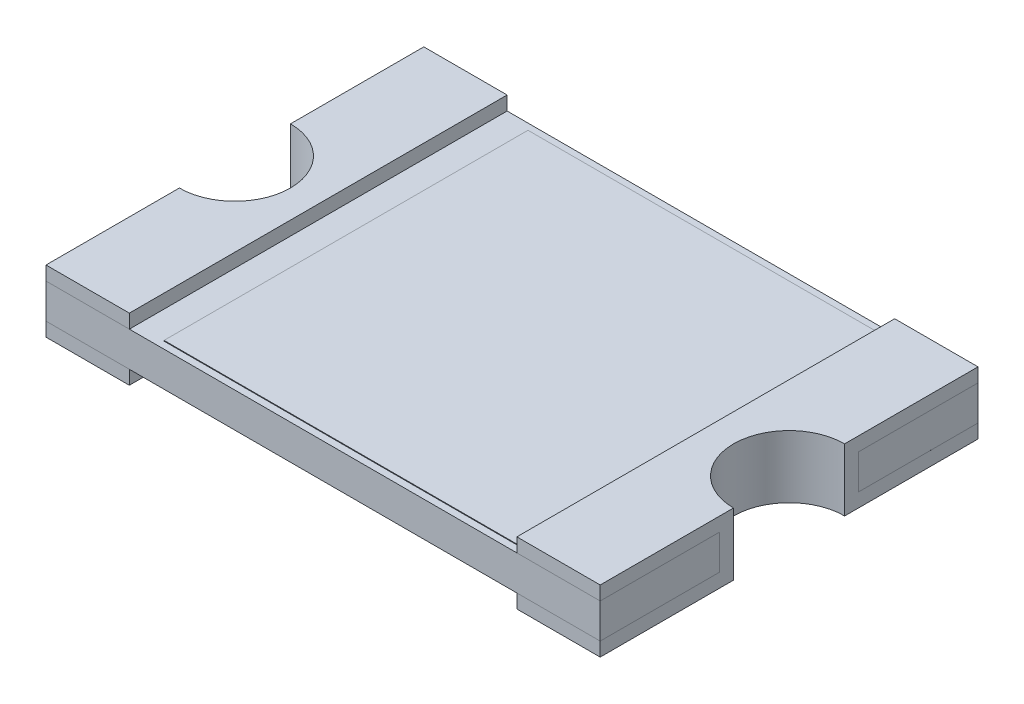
from build123d import *

# Parameters (mm, degrees)
BOSS_EXTRUDE1_START   = 2.72
SKETCH4_W             = 7.98
SKETCH4_H             = 0.5
BOSS_EXTRUDE1_DEPTH   = 5.44
BOSS_EXTRUDE2_START   = 2.72
SKETCH7_W             = 1.2
SKETCH7_H             = 0.2
BOSS_EXTRUDE2_DEPTH   = 5.44
BOSS_EXTRUDE2_2_DEPTH = 5.44
BOSS_EXTRUDE2_3_DEPTH = 5.44
BOSS_EXTRUDE2_4_DEPTH = 5.44
CUT_EXTRUDE1_DEPTH    = 5.912076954
BOSS_EXTRUDE3_DEPTH   = 0.9
BOSS_EXTRUDE4_START   = 0.7
SKETCH11_W            = 5.18
SKETCH11_H            = 5.24
BOSS_EXTRUDE4_DEPTH   = 0.01


with BuildPart() as part:
    # Sketch4 → Boss-Extrude1 (new body)
    with BuildSketch(Plane.XY.offset(BOSS_EXTRUDE1_START)):
        with Locations((0, 0.45)):
            Rectangle(SKETCH4_W, SKETCH4_H)
    extrude(amount=-BOSS_EXTRUDE1_DEPTH)


with BuildPart() as body_2:
    # Sketch7 → Boss-Extrude2 (new body)
    with BuildSketch(Plane.XY.offset(BOSS_EXTRUDE2_START)):
        with Locations((-3.39, 0.8)):
            Rectangle(SKETCH7_W, SKETCH7_H)
    extrude(amount=-BOSS_EXTRUDE2_DEPTH)


with BuildPart() as body_3:
    # Sketch7 → Boss-Extrude2 2 (new body)
    with BuildSketch(Plane.XY.offset(BOSS_EXTRUDE2_START)):
        with Locations((-3.39, 0.1)):
            Rectangle(SKETCH7_W, SKETCH7_H)
    extrude(amount=-BOSS_EXTRUDE2_2_DEPTH)


with BuildPart() as body_4:
    # Sketch7 → Boss-Extrude2 3 (new body)
    with BuildSketch(Plane.XY.offset(BOSS_EXTRUDE2_START)):
        with Locations((3.39, 0.8)):
            Rectangle(SKETCH7_W, SKETCH7_H)
    extrude(amount=-BOSS_EXTRUDE2_3_DEPTH)


with BuildPart() as body_5:
    # Sketch7 → Boss-Extrude2 4 (new body)
    with BuildSketch(Plane.XY.offset(BOSS_EXTRUDE2_START)):
        with Locations((3.39, 0.1)):
            Rectangle(SKETCH7_W, SKETCH7_H)
    extrude(amount=-BOSS_EXTRUDE2_4_DEPTH)


with BuildPart() as cut_extrude1_tool:
    # Sketch6 → Cut-Extrude1 (new, through all)
    with BuildSketch(Plane(origin=(0, 0, 0), x_dir=(1, 0, 0), z_dir=(0, 1, 0))):
        with BuildLine():
            Line((3.99, 1), (3.99, -1))
            ThreePointArc((3.99, -1), (2.99, 0), (3.99, 1))
        make_face()
        with BuildLine():
            Line((-3.99, 1), (-3.99, -1))
            ThreePointArc((-3.99, -1), (-2.99, 0), (-3.99, 1))
        make_face()
    extrude(amount=CUT_EXTRUDE1_DEPTH)


with BuildPart() as part_1:
    add(part.part)

    # Cut-Extrude1: cut by cut_extrude1_tool
    add(cut_extrude1_tool.part, mode=Mode.SUBTRACT)


with BuildPart() as body_2_1:
    add(body_2.part)

    # Cut-Extrude1: cut by cut_extrude1_tool
    add(cut_extrude1_tool.part, mode=Mode.SUBTRACT)



with BuildPart() as body_3_1:
    add(body_3.part)

    # Cut-Extrude1: cut by cut_extrude1_tool
    add(cut_extrude1_tool.part, mode=Mode.SUBTRACT)


with BuildPart() as body_4_1:
    add(body_4.part)

    # Cut-Extrude1: cut by cut_extrude1_tool
    add(cut_extrude1_tool.part, mode=Mode.SUBTRACT)


with BuildPart() as body_5_1:
    add(body_5.part)

    # Cut-Extrude1: cut by cut_extrude1_tool
    add(cut_extrude1_tool.part, mode=Mode.SUBTRACT)


with BuildPart() as body_2_2:
    add(body_2_1.part)

    add(body_3_1.part)  # Boss-Extrude3 merges body 3

    add(body_4_1.part)  # Boss-Extrude3 merges body 4

    add(body_5_1.part)  # Boss-Extrude3 merges body 5
    # Sketch9 → Boss-Extrude3 (add)
    with BuildSketch(Plane(origin=(0, 0, 0), x_dir=(1, 0, 0), z_dir=(0, 1, 0))):
        with BuildLine():
            Line((3.99, 1), (3.99, 0.8))
            ThreePointArc((3.99, 0.8), (3.19, 0), (3.99, -0.8))
            Line((3.99, -0.8), (3.99, -1))
            ThreePointArc((3.99, -1), (2.99, 0), (3.99, 1))
        make_face()
        with BuildLine():
            Line((-3.99, 1), (-3.99, 0.8))
            ThreePointArc((-3.99, 0.8), (-3.19, 0), (-3.99, -0.8))
            Line((-3.99, -0.8), (-3.99, -1))
            ThreePointArc((-3.99, -1), (-2.99, 0), (-3.99, 1))
        make_face()
    extrude(amount=BOSS_EXTRUDE3_DEPTH)


with BuildPart() as body_3_2:
    # Sketch11 → Boss-Extrude4 (new body)
    with BuildSketch(Plane(origin=(0, 0, 0), x_dir=(1, 0, 0), z_dir=(0, 1, 0)).offset(BOSS_EXTRUDE4_START)):
        with Locations((0.2, 0)):
            Rectangle(SKETCH11_W, SKETCH11_H)
    extrude(amount=BOSS_EXTRUDE4_DEPTH)


solid = Compound([part_1.part, body_2_2.part, body_3_2.part])
